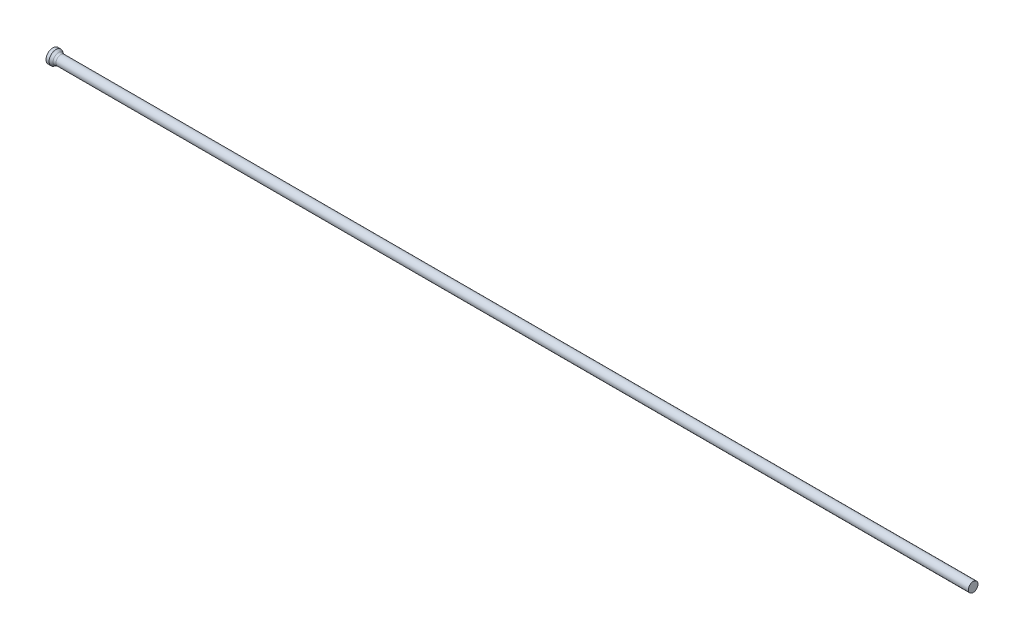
ISO-10303-21;
HEADER;
FILE_DESCRIPTION(('STEP AP214'),'2;1');
FILE_NAME('part.step','',(''),(''),'','','');
FILE_SCHEMA(('AUTOMOTIVE_DESIGN { 1 0 10303 214 1 1 1 1 }'));
ENDSEC;
DATA;
#1=APPLICATION_CONTEXT('core data for automotive mechanical design processes');
#2=APPLICATION_PROTOCOL_DEFINITION('international standard','automotive_design',2000,#1);
#3=PRODUCT_CONTEXT('',#1,'mechanical');
#4=PRODUCT('Part','Part','',(#3));
#5=PRODUCT_RELATED_PRODUCT_CATEGORY('part','',(#4));
#6=PRODUCT_DEFINITION_FORMATION('','',#4);
#7=PRODUCT_DEFINITION_CONTEXT('part definition',#1,'design');
#8=PRODUCT_DEFINITION('design','',#6,#7);
#9=PRODUCT_DEFINITION_SHAPE('','',#8);
#10=(LENGTH_UNIT() NAMED_UNIT(*) SI_UNIT(.MILLI.,.METRE.));
#11=(NAMED_UNIT(*) PLANE_ANGLE_UNIT() SI_UNIT($,.RADIAN.));
#12=(NAMED_UNIT(*) SI_UNIT($,.STERADIAN.) SOLID_ANGLE_UNIT());
#13=UNCERTAINTY_MEASURE_WITH_UNIT(LENGTH_MEASURE(1.E-05),#10,'distance_accuracy_value','');
#14=(GEOMETRIC_REPRESENTATION_CONTEXT(3) GLOBAL_UNCERTAINTY_ASSIGNED_CONTEXT((#13)) GLOBAL_UNIT_ASSIGNED_CONTEXT((#10,
#11,#12)) REPRESENTATION_CONTEXT('',''));
#15=CARTESIAN_POINT('',(0.,0.,0.));
#16=DIRECTION('',(0.,0.,1.));
#17=DIRECTION('',(1.,0.,0.));
#18=AXIS2_PLACEMENT_3D('',#15,#16,#17);
#19=CARTESIAN_POINT('',(0.,0.,0.));
#20=DIRECTION('',(1.,0.,0.));
#21=DIRECTION('',(0.,0.,-1.));
#22=AXIS2_PLACEMENT_3D('',#19,#20,#21);
#23=PLANE('',#22);
#24=CARTESIAN_POINT('',(0.,0.,0.));
#25=DIRECTION('',(-1.,0.,0.));
#26=DIRECTION('',(0.,0.,1.));
#27=AXIS2_PLACEMENT_3D('',#24,#25,#26);
#28=CIRCLE('',#27,1.5);
#29=CARTESIAN_POINT('',(0.,0.,1.5));
#30=VERTEX_POINT('',#29);
#31=EDGE_CURVE('E25',#30,#30,#28,.T.);
#32=ORIENTED_EDGE('',*,*,#31,.T.);
#33=EDGE_LOOP('',(#32));
#34=FACE_BOUND('',#33,.T.);
#35=ADVANCED_FACE('F14',(#34),#23,.F.);
#36=CARTESIAN_POINT('',(0.,0.,0.));
#37=DIRECTION('',(-1.,0.,0.));
#38=DIRECTION('',(0.,0.,1.));
#39=AXIS2_PLACEMENT_3D('',#36,#37,#38);
#40=CYLINDRICAL_SURFACE('',#39,1.5);
#41=ORIENTED_EDGE('',*,*,#31,.F.);
#42=EDGE_LOOP('',(#41));
#43=FACE_BOUND('',#42,.T.);
#44=CARTESIAN_POINT('',(0.670577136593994,0.,0.));
#45=DIRECTION('',(-1.,0.,0.));
#46=DIRECTION('',(0.,0.,1.));
#47=AXIS2_PLACEMENT_3D('',#44,#45,#46);
#48=CIRCLE('',#47,1.5);
#49=CARTESIAN_POINT('',(0.670577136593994,0.,1.5));
#50=VERTEX_POINT('',#49);
#51=EDGE_CURVE('E29',#50,#50,#48,.T.);
#52=ORIENTED_EDGE('',*,*,#51,.T.);
#53=EDGE_LOOP('',(#52));
#54=FACE_BOUND('',#53,.T.);
#55=ADVANCED_FACE('F53',(#43,#54),#40,.T.);
#56=CARTESIAN_POINT('',(1.45,0.,0.));
#57=DIRECTION('',(-1.,0.,0.));
#58=DIRECTION('',(0.,0.,1.));
#59=AXIS2_PLACEMENT_3D('',#56,#57,#58);
#60=CONICAL_SURFACE('',#59,1.05,0.523598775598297);
#61=CARTESIAN_POINT('',(1.21794919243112,0.,0.));
#62=DIRECTION('',(-1.,0.,0.));
#63=DIRECTION('',(0.,0.,1.));
#64=AXIS2_PLACEMENT_3D('',#61,#62,#63);
#65=CIRCLE('',#64,1.18397459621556);
#66=CARTESIAN_POINT('',(1.21794919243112,0.,1.18397459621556));
#67=VERTEX_POINT('',#66);
#68=EDGE_CURVE('E21',#67,#67,#65,.T.);
#69=ORIENTED_EDGE('',*,*,#68,.T.);
#70=EDGE_LOOP('',(#69));
#71=FACE_BOUND('',#70,.T.);
#72=ORIENTED_EDGE('',*,*,#51,.F.);
#73=EDGE_LOOP('',(#72));
#74=FACE_BOUND('',#73,.T.);
#75=ADVANCED_FACE('F50',(#71,#74),#60,.T.);
#76=CARTESIAN_POINT('',(0.,0.,0.));
#77=DIRECTION('',(-1.,0.,0.));
#78=DIRECTION('',(0.,0.,1.));
#79=AXIS2_PLACEMENT_3D('',#76,#77,#78);
#80=CYLINDRICAL_SURFACE('',#79,1.05);
#81=CARTESIAN_POINT('',(1.71794919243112,0.,0.));
#82=DIRECTION('',(-1.,0.,0.));
#83=DIRECTION('',(0.,0.,1.));
#84=AXIS2_PLACEMENT_3D('',#81,#82,#83);
#85=CIRCLE('',#84,1.05);
#86=CARTESIAN_POINT('',(1.71794919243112,0.,1.05));
#87=VERTEX_POINT('',#86);
#88=EDGE_CURVE('E9',#87,#87,#85,.F.);
#89=ORIENTED_EDGE('',*,*,#88,.T.);
#90=EDGE_LOOP('',(#89));
#91=FACE_BOUND('',#90,.T.);
#92=CARTESIAN_POINT('',(200.,0.,0.));
#93=DIRECTION('',(-1.,0.,0.));
#94=DIRECTION('',(0.,0.,1.));
#95=AXIS2_PLACEMENT_3D('',#92,#93,#94);
#96=CIRCLE('',#95,1.05);
#97=CARTESIAN_POINT('',(200.,0.,1.05));
#98=VERTEX_POINT('',#97);
#99=EDGE_CURVE('E34',#98,#98,#96,.T.);
#100=ORIENTED_EDGE('',*,*,#99,.T.);
#101=EDGE_LOOP('',(#100));
#102=FACE_BOUND('',#101,.T.);
#103=ADVANCED_FACE('F38',(#91,#102),#80,.T.);
#104=CARTESIAN_POINT('',(200.,1.05,0.));
#105=DIRECTION('',(-1.,0.,0.));
#106=DIRECTION('',(0.,0.,1.));
#107=AXIS2_PLACEMENT_3D('',#104,#105,#106);
#108=PLANE('',#107);
#109=ORIENTED_EDGE('',*,*,#99,.F.);
#110=EDGE_LOOP('',(#109));
#111=FACE_BOUND('',#110,.T.);
#112=ADVANCED_FACE('F40',(#111),#108,.F.);
#113=CARTESIAN_POINT('',(1.71794919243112,0.,0.));
#114=DIRECTION('',(-1.,0.,0.));
#115=DIRECTION('',(0.,0.,1.));
#116=AXIS2_PLACEMENT_3D('',#113,#114,#115);
#117=TOROIDAL_SURFACE('',#116,2.05,1.);
#118=ORIENTED_EDGE('',*,*,#88,.F.);
#119=EDGE_LOOP('',(#118));
#120=FACE_BOUND('',#119,.T.);
#121=ORIENTED_EDGE('',*,*,#68,.F.);
#122=EDGE_LOOP('',(#121));
#123=FACE_BOUND('',#122,.T.);
#124=ADVANCED_FACE('F16',(#120,#123),#117,.F.);
#125=CLOSED_SHELL('',(#35,#55,#75,#103,#112,#124));
#126=MANIFOLD_SOLID_BREP('B1',#125);
#127=ADVANCED_BREP_SHAPE_REPRESENTATION('',(#18,#126),#14);
#128=SHAPE_DEFINITION_REPRESENTATION(#9,#127);
ENDSEC;
END-ISO-10303-21;
